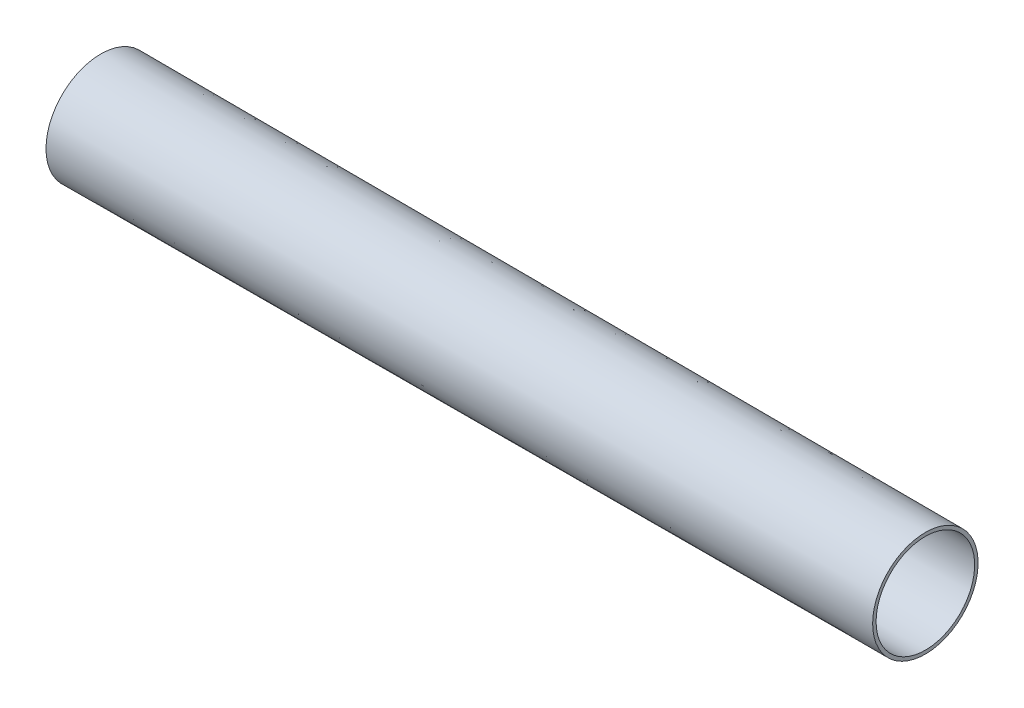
ISO-10303-21;
HEADER;
FILE_DESCRIPTION(('STEP AP214'),'2;1');
FILE_NAME('part.step','',(''),(''),'','','');
FILE_SCHEMA(('AUTOMOTIVE_DESIGN { 1 0 10303 214 1 1 1 1 }'));
ENDSEC;
DATA;
#1=APPLICATION_CONTEXT('core data for automotive mechanical design processes');
#2=APPLICATION_PROTOCOL_DEFINITION('international standard','automotive_design',2000,#1);
#3=PRODUCT_CONTEXT('',#1,'mechanical');
#4=PRODUCT('Part','Part','',(#3));
#5=PRODUCT_RELATED_PRODUCT_CATEGORY('part','',(#4));
#6=PRODUCT_DEFINITION_FORMATION('','',#4);
#7=PRODUCT_DEFINITION_CONTEXT('part definition',#1,'design');
#8=PRODUCT_DEFINITION('design','',#6,#7);
#9=PRODUCT_DEFINITION_SHAPE('','',#8);
#10=(LENGTH_UNIT() NAMED_UNIT(*) SI_UNIT(.MILLI.,.METRE.));
#11=(NAMED_UNIT(*) PLANE_ANGLE_UNIT() SI_UNIT($,.RADIAN.));
#12=(NAMED_UNIT(*) SI_UNIT($,.STERADIAN.) SOLID_ANGLE_UNIT());
#13=UNCERTAINTY_MEASURE_WITH_UNIT(LENGTH_MEASURE(1.E-05),#10,'distance_accuracy_value','');
#14=(GEOMETRIC_REPRESENTATION_CONTEXT(3) GLOBAL_UNCERTAINTY_ASSIGNED_CONTEXT((#13)) GLOBAL_UNIT_ASSIGNED_CONTEXT((#10,
#11,#12)) REPRESENTATION_CONTEXT('',''));
#15=CARTESIAN_POINT('',(0.,0.,0.));
#16=DIRECTION('',(0.,0.,1.));
#17=DIRECTION('',(1.,0.,0.));
#18=AXIS2_PLACEMENT_3D('',#15,#16,#17);
#19=CARTESIAN_POINT('',(34.29,0.,0.));
#20=DIRECTION('',(-1.,0.,0.));
#21=DIRECTION('',(0.,0.,1.));
#22=AXIS2_PLACEMENT_3D('',#19,#20,#21);
#23=CONICAL_SURFACE('',#22,14.9968085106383,0.00238894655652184);
#24=CARTESIAN_POINT('',(275.59,0.,0.));
#25=DIRECTION('',(-1.,0.,0.));
#26=DIRECTION('',(0.,0.,1.));
#27=AXIS2_PLACEMENT_3D('',#24,#25,#26);
#28=CIRCLE('',#27,14.4203546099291);
#29=CARTESIAN_POINT('',(275.59,0.,14.4203546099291));
#30=VERTEX_POINT('',#29);
#31=EDGE_CURVE('E10',#30,#30,#28,.T.);
#32=ORIENTED_EDGE('',*,*,#31,.F.);
#33=EDGE_LOOP('',(#32));
#34=FACE_BOUND('',#33,.T.);
#35=CARTESIAN_POINT('',(34.29,0.,0.));
#36=DIRECTION('',(-1.,0.,0.));
#37=DIRECTION('',(0.,0.,1.));
#38=AXIS2_PLACEMENT_3D('',#35,#36,#37);
#39=CIRCLE('',#38,14.9968085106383);
#40=CARTESIAN_POINT('',(34.29,0.,14.9968085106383));
#41=VERTEX_POINT('',#40);
#42=EDGE_CURVE('E47',#41,#41,#39,.T.);
#43=ORIENTED_EDGE('',*,*,#42,.T.);
#44=EDGE_LOOP('',(#43));
#45=FACE_BOUND('',#44,.T.);
#46=ADVANCED_FACE('F33',(#34,#45),#23,.F.);
#47=CARTESIAN_POINT('',(275.59,14.4203546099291,0.));
#48=DIRECTION('',(-1.,0.,0.));
#49=DIRECTION('',(0.,0.,1.));
#50=AXIS2_PLACEMENT_3D('',#47,#48,#49);
#51=PLANE('',#50);
#52=CARTESIAN_POINT('',(275.59,0.,0.));
#53=DIRECTION('',(-1.,0.,0.));
#54=DIRECTION('',(0.,0.,1.));
#55=AXIS2_PLACEMENT_3D('',#52,#53,#54);
#56=CIRCLE('',#55,15.4291489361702);
#57=CARTESIAN_POINT('',(275.59,0.,15.4291489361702));
#58=VERTEX_POINT('',#57);
#59=EDGE_CURVE('E39',#58,#58,#56,.T.);
#60=ORIENTED_EDGE('',*,*,#59,.F.);
#61=EDGE_LOOP('',(#60));
#62=FACE_BOUND('',#61,.T.);
#63=ORIENTED_EDGE('',*,*,#31,.T.);
#64=EDGE_LOOP('',(#63));
#65=FACE_BOUND('',#64,.T.);
#66=ADVANCED_FACE('F62',(#62,#65),#51,.F.);
#67=CARTESIAN_POINT('',(275.59,0.,0.));
#68=DIRECTION('',(-1.,0.,0.));
#69=DIRECTION('',(0.,0.,1.));
#70=AXIS2_PLACEMENT_3D('',#67,#68,#69);
#71=CONICAL_SURFACE('',#70,15.4291489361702,0.00238894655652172);
#72=CARTESIAN_POINT('',(34.29,0.,0.));
#73=DIRECTION('',(-1.,0.,0.));
#74=DIRECTION('',(0.,0.,1.));
#75=AXIS2_PLACEMENT_3D('',#72,#73,#74);
#76=CIRCLE('',#75,16.0056028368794);
#77=CARTESIAN_POINT('',(34.29,0.,16.0056028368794));
#78=VERTEX_POINT('',#77);
#79=EDGE_CURVE('E43',#78,#78,#76,.T.);
#80=ORIENTED_EDGE('',*,*,#79,.F.);
#81=EDGE_LOOP('',(#80));
#82=FACE_BOUND('',#81,.T.);
#83=ORIENTED_EDGE('',*,*,#59,.T.);
#84=EDGE_LOOP('',(#83));
#85=FACE_BOUND('',#84,.T.);
#86=ADVANCED_FACE('F57',(#82,#85),#71,.T.);
#87=CARTESIAN_POINT('',(34.29,16.0056028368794,0.));
#88=DIRECTION('',(1.,0.,0.));
#89=DIRECTION('',(0.,0.,-1.));
#90=AXIS2_PLACEMENT_3D('',#87,#88,#89);
#91=PLANE('',#90);
#92=ORIENTED_EDGE('',*,*,#42,.F.);
#93=EDGE_LOOP('',(#92));
#94=FACE_BOUND('',#93,.T.);
#95=ORIENTED_EDGE('',*,*,#79,.T.);
#96=EDGE_LOOP('',(#95));
#97=FACE_BOUND('',#96,.T.);
#98=ADVANCED_FACE('F54',(#94,#97),#91,.F.);
#99=CLOSED_SHELL('',(#46,#66,#86,#98));
#100=MANIFOLD_SOLID_BREP('B2',#99);
#101=ADVANCED_BREP_SHAPE_REPRESENTATION('',(#18,#100),#14);
#102=SHAPE_DEFINITION_REPRESENTATION(#9,#101);
ENDSEC;
END-ISO-10303-21;
